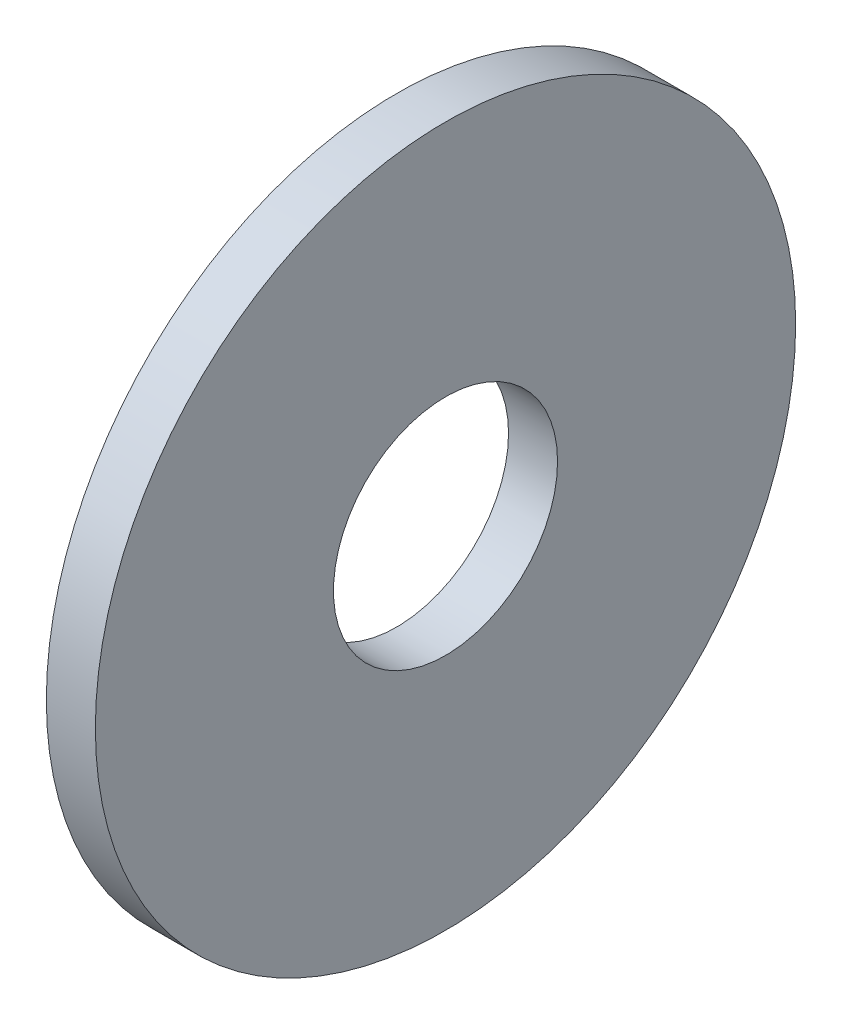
ISO-10303-21;
HEADER;
FILE_DESCRIPTION(('STEP AP214'),'2;1');
FILE_NAME('part.step','',(''),(''),'','','');
FILE_SCHEMA(('AUTOMOTIVE_DESIGN { 1 0 10303 214 1 1 1 1 }'));
ENDSEC;
DATA;
#1=APPLICATION_CONTEXT('core data for automotive mechanical design processes');
#2=APPLICATION_PROTOCOL_DEFINITION('international standard','automotive_design',2000,#1);
#3=PRODUCT_CONTEXT('',#1,'mechanical');
#4=PRODUCT('Part','Part','',(#3));
#5=PRODUCT_RELATED_PRODUCT_CATEGORY('part','',(#4));
#6=PRODUCT_DEFINITION_FORMATION('','',#4);
#7=PRODUCT_DEFINITION_CONTEXT('part definition',#1,'design');
#8=PRODUCT_DEFINITION('design','',#6,#7);
#9=PRODUCT_DEFINITION_SHAPE('','',#8);
#10=(LENGTH_UNIT() NAMED_UNIT(*) SI_UNIT(.MILLI.,.METRE.));
#11=(NAMED_UNIT(*) PLANE_ANGLE_UNIT() SI_UNIT($,.RADIAN.));
#12=(NAMED_UNIT(*) SI_UNIT($,.STERADIAN.) SOLID_ANGLE_UNIT());
#13=UNCERTAINTY_MEASURE_WITH_UNIT(LENGTH_MEASURE(1.E-05),#10,'distance_accuracy_value','');
#14=(GEOMETRIC_REPRESENTATION_CONTEXT(3) GLOBAL_UNCERTAINTY_ASSIGNED_CONTEXT((#13)) GLOBAL_UNIT_ASSIGNED_CONTEXT((#10,
#11,#12)) REPRESENTATION_CONTEXT('',''));
#15=CARTESIAN_POINT('',(0.,0.,0.));
#16=DIRECTION('',(0.,0.,1.));
#17=DIRECTION('',(1.,0.,0.));
#18=AXIS2_PLACEMENT_3D('',#15,#16,#17);
#19=CARTESIAN_POINT('',(1.4,0.,0.));
#20=DIRECTION('',(1.,0.,0.));
#21=DIRECTION('',(0.,0.,-1.));
#22=AXIS2_PLACEMENT_3D('',#19,#20,#21);
#23=PLANE('',#22);
#24=CARTESIAN_POINT('',(1.4,0.,0.));
#25=DIRECTION('',(1.,0.,0.));
#26=DIRECTION('',(0.,0.,-1.));
#27=AXIS2_PLACEMENT_3D('',#24,#25,#26);
#28=CIRCLE('',#27,10.);
#29=CARTESIAN_POINT('',(1.4,0.,-10.));
#30=VERTEX_POINT('',#29);
#31=EDGE_CURVE('E10',#30,#30,#28,.T.);
#32=ORIENTED_EDGE('',*,*,#31,.T.);
#33=EDGE_LOOP('',(#32));
#34=FACE_BOUND('',#33,.T.);
#35=CARTESIAN_POINT('',(1.4,0.,0.));
#36=DIRECTION('',(1.,0.,0.));
#37=DIRECTION('',(0.,0.,-1.));
#38=AXIS2_PLACEMENT_3D('',#35,#36,#37);
#39=CIRCLE('',#38,3.2);
#40=CARTESIAN_POINT('',(1.4,0.,-3.2));
#41=VERTEX_POINT('',#40);
#42=EDGE_CURVE('E50',#41,#41,#39,.T.);
#43=ORIENTED_EDGE('',*,*,#42,.F.);
#44=EDGE_LOOP('',(#43));
#45=FACE_BOUND('',#44,.T.);
#46=ADVANCED_FACE('F39',(#34,#45),#23,.T.);
#47=CARTESIAN_POINT('',(0.,0.,0.));
#48=DIRECTION('',(1.,0.,0.));
#49=DIRECTION('',(0.,0.,-1.));
#50=AXIS2_PLACEMENT_3D('',#47,#48,#49);
#51=PLANE('',#50);
#52=CARTESIAN_POINT('',(0.,0.,0.));
#53=DIRECTION('',(1.,0.,0.));
#54=DIRECTION('',(0.,0.,-1.));
#55=AXIS2_PLACEMENT_3D('',#52,#53,#54);
#56=CIRCLE('',#55,10.);
#57=CARTESIAN_POINT('',(0.,0.,-10.));
#58=VERTEX_POINT('',#57);
#59=EDGE_CURVE('E43',#58,#58,#56,.T.);
#60=ORIENTED_EDGE('',*,*,#59,.F.);
#61=EDGE_LOOP('',(#60));
#62=FACE_BOUND('',#61,.T.);
#63=CARTESIAN_POINT('',(0.,0.,0.));
#64=DIRECTION('',(1.,0.,0.));
#65=DIRECTION('',(0.,0.,-1.));
#66=AXIS2_PLACEMENT_3D('',#63,#64,#65);
#67=CIRCLE('',#66,3.2);
#68=CARTESIAN_POINT('',(0.,0.,-3.2));
#69=VERTEX_POINT('',#68);
#70=EDGE_CURVE('E52',#69,#69,#67,.T.);
#71=ORIENTED_EDGE('',*,*,#70,.T.);
#72=EDGE_LOOP('',(#71));
#73=FACE_BOUND('',#72,.T.);
#74=ADVANCED_FACE('F62',(#62,#73),#51,.F.);
#75=CARTESIAN_POINT('',(1.4,0.,0.));
#76=DIRECTION('',(-1.,0.,0.));
#77=DIRECTION('',(0.,0.,1.));
#78=AXIS2_PLACEMENT_3D('',#75,#76,#77);
#79=CYLINDRICAL_SURFACE('',#78,10.);
#80=ORIENTED_EDGE('',*,*,#31,.F.);
#81=EDGE_LOOP('',(#80));
#82=FACE_BOUND('',#81,.T.);
#83=ORIENTED_EDGE('',*,*,#59,.T.);
#84=EDGE_LOOP('',(#83));
#85=FACE_BOUND('',#84,.T.);
#86=ADVANCED_FACE('F41',(#82,#85),#79,.T.);
#87=CARTESIAN_POINT('',(1.4,0.,0.));
#88=DIRECTION('',(-1.,0.,0.));
#89=DIRECTION('',(0.,0.,1.));
#90=AXIS2_PLACEMENT_3D('',#87,#88,#89);
#91=CYLINDRICAL_SURFACE('',#90,3.2);
#92=ORIENTED_EDGE('',*,*,#42,.T.);
#93=EDGE_LOOP('',(#92));
#94=FACE_BOUND('',#93,.T.);
#95=ORIENTED_EDGE('',*,*,#70,.F.);
#96=EDGE_LOOP('',(#95));
#97=FACE_BOUND('',#96,.T.);
#98=ADVANCED_FACE('F58',(#94,#97),#91,.F.);
#99=CLOSED_SHELL('',(#46,#74,#86,#98));
#100=MANIFOLD_SOLID_BREP('B2',#99);
#101=ADVANCED_BREP_SHAPE_REPRESENTATION('',(#18,#100),#14);
#102=SHAPE_DEFINITION_REPRESENTATION(#9,#101);
ENDSEC;
END-ISO-10303-21;
